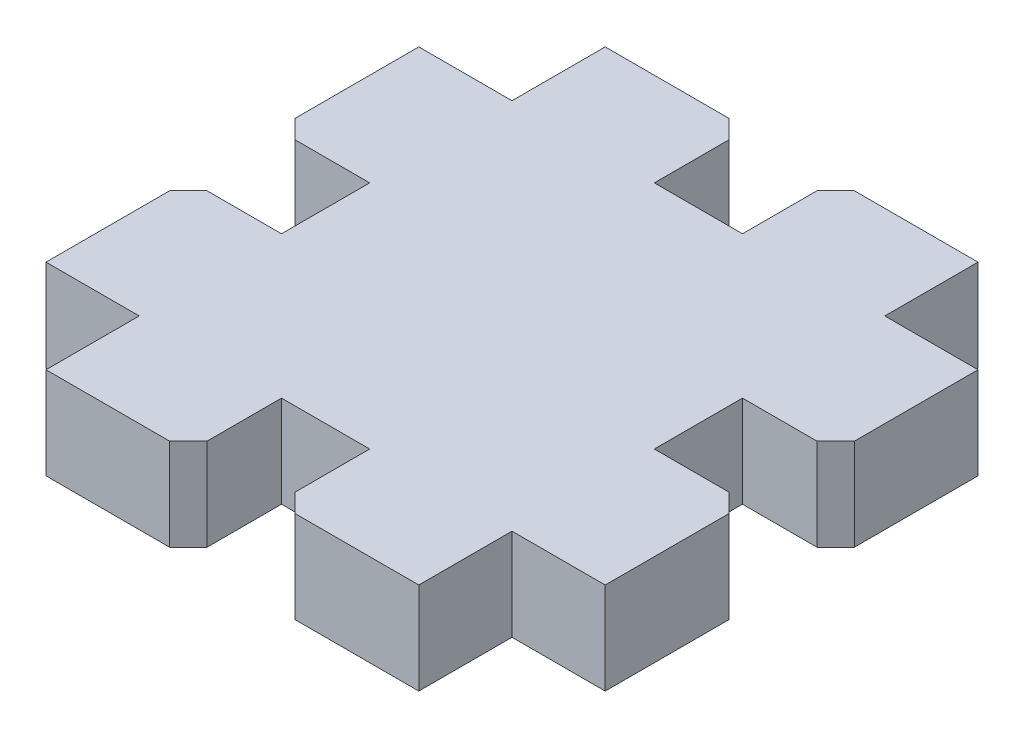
ISO-10303-21;
HEADER;
FILE_DESCRIPTION(('STEP AP214'),'2;1');
FILE_NAME('part.step','',(''),(''),'','','');
FILE_SCHEMA(('AUTOMOTIVE_DESIGN { 1 0 10303 214 1 1 1 1 }'));
ENDSEC;
DATA;
#1=APPLICATION_CONTEXT('core data for automotive mechanical design processes');
#2=APPLICATION_PROTOCOL_DEFINITION('international standard','automotive_design',2000,#1);
#3=PRODUCT_CONTEXT('',#1,'mechanical');
#4=PRODUCT('Part','Part','',(#3));
#5=PRODUCT_RELATED_PRODUCT_CATEGORY('part','',(#4));
#6=PRODUCT_DEFINITION_FORMATION('','',#4);
#7=PRODUCT_DEFINITION_CONTEXT('part definition',#1,'design');
#8=PRODUCT_DEFINITION('design','',#6,#7);
#9=PRODUCT_DEFINITION_SHAPE('','',#8);
#10=(LENGTH_UNIT() NAMED_UNIT(*) SI_UNIT(.MILLI.,.METRE.));
#11=(NAMED_UNIT(*) PLANE_ANGLE_UNIT() SI_UNIT($,.RADIAN.));
#12=(NAMED_UNIT(*) SI_UNIT($,.STERADIAN.) SOLID_ANGLE_UNIT());
#13=UNCERTAINTY_MEASURE_WITH_UNIT(LENGTH_MEASURE(1.E-05),#10,'distance_accuracy_value','');
#14=(GEOMETRIC_REPRESENTATION_CONTEXT(3) GLOBAL_UNCERTAINTY_ASSIGNED_CONTEXT((#13)) GLOBAL_UNIT_ASSIGNED_CONTEXT((#10,
#11,#12)) REPRESENTATION_CONTEXT('',''));
#15=CARTESIAN_POINT('',(0.,0.,0.));
#16=DIRECTION('',(0.,0.,1.));
#17=DIRECTION('',(1.,0.,0.));
#18=AXIS2_PLACEMENT_3D('',#15,#16,#17);
#19=CARTESIAN_POINT('',(-12.7,6.2611,11.2645620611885));
#20=DIRECTION('',(0.,0.,-1.));
#21=DIRECTION('',(-1.,0.,0.));
#22=AXIS2_PLACEMENT_3D('',#19,#20,#21);
#23=PLANE('',#22);
#24=DIRECTION('',(1.,0.,0.));
#25=VECTOR('',#24,1.);
#26=CARTESIAN_POINT('',(-12.7,0.,11.2645620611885));
#27=LINE('',#26,#25);
#28=CARTESIAN_POINT('',(-12.7,0.,11.2645620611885));
#29=VERTEX_POINT('',#28);
#30=CARTESIAN_POINT('',(-4.27355000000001,0.,11.2645620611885));
#31=VERTEX_POINT('',#30);
#32=EDGE_CURVE('E354',#29,#31,#27,.T.);
#33=ORIENTED_EDGE('',*,*,#32,.T.);
#34=DIRECTION('',(0.,1.,0.));
#35=VECTOR('',#34,1.);
#36=CARTESIAN_POINT('',(-4.27355000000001,6.2611,11.2645620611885));
#37=LINE('',#36,#35);
#38=CARTESIAN_POINT('',(-4.27355000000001,6.2611,11.2645620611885));
#39=VERTEX_POINT('',#38);
#40=EDGE_CURVE('E526',#31,#39,#37,.T.);
#41=ORIENTED_EDGE('',*,*,#40,.T.);
#42=DIRECTION('',(1.,0.,0.));
#43=VECTOR('',#42,1.);
#44=CARTESIAN_POINT('',(-12.7,6.2611,11.2645620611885));
#45=LINE('',#44,#43);
#46=CARTESIAN_POINT('',(-12.7,6.2611,11.2645620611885));
#47=VERTEX_POINT('',#46);
#48=EDGE_CURVE('E281',#47,#39,#45,.T.);
#49=ORIENTED_EDGE('',*,*,#48,.F.);
#50=DIRECTION('',(0.,-1.,0.));
#51=VECTOR('',#50,1.);
#52=CARTESIAN_POINT('',(-12.7,6.2611,11.2645620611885));
#53=LINE('',#52,#51);
#54=EDGE_CURVE('E353',#47,#29,#53,.T.);
#55=ORIENTED_EDGE('',*,*,#54,.T.);
#56=EDGE_LOOP('',(#33,#41,#49,#55));
#57=FACE_BOUND('',#56,.T.);
#58=ADVANCED_FACE('F35',(#57),#23,.F.);
#59=CARTESIAN_POINT('',(-3.00355,6.2611,11.2645620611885));
#60=DIRECTION('',(-1.,0.,0.));
#61=DIRECTION('',(0.,0.,1.));
#62=AXIS2_PLACEMENT_3D('',#59,#60,#61);
#63=PLANE('',#62);
#64=DIRECTION('',(0.,0.,-1.));
#65=VECTOR('',#64,1.);
#66=CARTESIAN_POINT('',(-3.00355,6.2611,11.2645620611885));
#67=LINE('',#66,#65);
#68=CARTESIAN_POINT('',(-3.00355,6.2611,9.99456206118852));
#69=VERTEX_POINT('',#68);
#70=CARTESIAN_POINT('',(-3.00355,6.2611,4.91456206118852));
#71=VERTEX_POINT('',#70);
#72=EDGE_CURVE('E267',#69,#71,#67,.T.);
#73=ORIENTED_EDGE('',*,*,#72,.F.);
#74=DIRECTION('',(0.,-1.,0.));
#75=VECTOR('',#74,1.);
#76=CARTESIAN_POINT('',(-3.00355,6.2611,9.99456206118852));
#77=LINE('',#76,#75);
#78=CARTESIAN_POINT('',(-3.00355,0.,9.99456206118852));
#79=VERTEX_POINT('',#78);
#80=EDGE_CURVE('E524',#69,#79,#77,.T.);
#81=ORIENTED_EDGE('',*,*,#80,.T.);
#82=DIRECTION('',(0.,0.,-1.));
#83=VECTOR('',#82,1.);
#84=CARTESIAN_POINT('',(-3.00355,0.,11.2645620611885));
#85=LINE('',#84,#83);
#86=CARTESIAN_POINT('',(-3.00355,0.,4.91456206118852));
#87=VERTEX_POINT('',#86);
#88=EDGE_CURVE('E287',#79,#87,#85,.T.);
#89=ORIENTED_EDGE('',*,*,#88,.T.);
#90=DIRECTION('',(0.,-1.,0.));
#91=VECTOR('',#90,1.);
#92=CARTESIAN_POINT('',(-3.00355,6.2611,4.91456206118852));
#93=LINE('',#92,#91);
#94=EDGE_CURVE('E284',#71,#87,#93,.T.);
#95=ORIENTED_EDGE('',*,*,#94,.F.);
#96=EDGE_LOOP('',(#73,#81,#89,#95));
#97=FACE_BOUND('',#96,.T.);
#98=ADVANCED_FACE('F285',(#97),#63,.F.);
#99=CARTESIAN_POINT('',(-3.00355,6.2611,4.91456206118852));
#100=DIRECTION('',(0.,0.,-1.));
#101=DIRECTION('',(-1.,0.,0.));
#102=AXIS2_PLACEMENT_3D('',#99,#100,#101);
#103=PLANE('',#102);
#104=DIRECTION('',(1.,0.,0.));
#105=VECTOR('',#104,1.);
#106=CARTESIAN_POINT('',(-3.00355,0.,4.91456206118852));
#107=LINE('',#106,#105);
#108=CARTESIAN_POINT('',(3.00355,0.,4.91456206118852));
#109=VERTEX_POINT('',#108);
#110=EDGE_CURVE('E358',#87,#109,#107,.T.);
#111=ORIENTED_EDGE('',*,*,#110,.T.);
#112=DIRECTION('',(0.,-1.,0.));
#113=VECTOR('',#112,1.);
#114=CARTESIAN_POINT('',(3.00355,6.2611,4.91456206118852));
#115=LINE('',#114,#113);
#116=CARTESIAN_POINT('',(3.00355,6.2611,4.91456206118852));
#117=VERTEX_POINT('',#116);
#118=EDGE_CURVE('E291',#117,#109,#115,.T.);
#119=ORIENTED_EDGE('',*,*,#118,.F.);
#120=DIRECTION('',(1.,0.,0.));
#121=VECTOR('',#120,1.);
#122=CARTESIAN_POINT('',(-3.00355,6.2611,4.91456206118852));
#123=LINE('',#122,#121);
#124=EDGE_CURVE('E273',#71,#117,#123,.T.);
#125=ORIENTED_EDGE('',*,*,#124,.F.);
#126=ORIENTED_EDGE('',*,*,#94,.T.);
#127=EDGE_LOOP('',(#111,#119,#125,#126));
#128=FACE_BOUND('',#127,.T.);
#129=ADVANCED_FACE('F293',(#128),#103,.F.);
#130=CARTESIAN_POINT('',(3.00355,6.2611,11.2645620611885));
#131=DIRECTION('',(1.,0.,0.));
#132=DIRECTION('',(0.,0.,-1.));
#133=AXIS2_PLACEMENT_3D('',#130,#131,#132);
#134=PLANE('',#133);
#135=DIRECTION('',(0.,0.,1.));
#136=VECTOR('',#135,1.);
#137=CARTESIAN_POINT('',(3.00355,0.,11.2645620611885));
#138=LINE('',#137,#136);
#139=CARTESIAN_POINT('',(3.00355,0.,9.99456206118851));
#140=VERTEX_POINT('',#139);
#141=EDGE_CURVE('E360',#109,#140,#138,.T.);
#142=ORIENTED_EDGE('',*,*,#141,.T.);
#143=DIRECTION('',(0.,1.,0.));
#144=VECTOR('',#143,1.);
#145=CARTESIAN_POINT('',(3.00355,6.2611,9.99456206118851));
#146=LINE('',#145,#144);
#147=CARTESIAN_POINT('',(3.00355,6.2611,9.99456206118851));
#148=VERTEX_POINT('',#147);
#149=EDGE_CURVE('E522',#140,#148,#146,.T.);
#150=ORIENTED_EDGE('',*,*,#149,.T.);
#151=DIRECTION('',(0.,0.,1.));
#152=VECTOR('',#151,1.);
#153=CARTESIAN_POINT('',(3.00355,6.2611,11.2645620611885));
#154=LINE('',#153,#152);
#155=EDGE_CURVE('E296',#117,#148,#154,.T.);
#156=ORIENTED_EDGE('',*,*,#155,.F.);
#157=ORIENTED_EDGE('',*,*,#118,.T.);
#158=EDGE_LOOP('',(#142,#150,#156,#157));
#159=FACE_BOUND('',#158,.T.);
#160=ADVANCED_FACE('F576',(#159),#134,.F.);
#161=CARTESIAN_POINT('',(12.7,6.2611,11.2645620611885));
#162=DIRECTION('',(0.,0.,-1.));
#163=DIRECTION('',(-1.,0.,0.));
#164=AXIS2_PLACEMENT_3D('',#161,#162,#163);
#165=PLANE('',#164);
#166=DIRECTION('',(1.,0.,0.));
#167=VECTOR('',#166,1.);
#168=CARTESIAN_POINT('',(12.7,6.2611,11.2645620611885));
#169=LINE('',#168,#167);
#170=CARTESIAN_POINT('',(4.27355,6.2611,11.2645620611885));
#171=VERTEX_POINT('',#170);
#172=CARTESIAN_POINT('',(12.7,6.2611,11.2645620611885));
#173=VERTEX_POINT('',#172);
#174=EDGE_CURVE('E298',#171,#173,#169,.T.);
#175=ORIENTED_EDGE('',*,*,#174,.F.);
#176=DIRECTION('',(0.,-1.,0.));
#177=VECTOR('',#176,1.);
#178=CARTESIAN_POINT('',(4.27355,6.2611,11.2645620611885));
#179=LINE('',#178,#177);
#180=CARTESIAN_POINT('',(4.27355,0.,11.2645620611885));
#181=VERTEX_POINT('',#180);
#182=EDGE_CURVE('E519',#171,#181,#179,.T.);
#183=ORIENTED_EDGE('',*,*,#182,.T.);
#184=DIRECTION('',(1.,0.,0.));
#185=VECTOR('',#184,1.);
#186=CARTESIAN_POINT('',(12.7,0.,11.2645620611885));
#187=LINE('',#186,#185);
#188=CARTESIAN_POINT('',(12.7,0.,11.2645620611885));
#189=VERTEX_POINT('',#188);
#190=EDGE_CURVE('E363',#181,#189,#187,.T.);
#191=ORIENTED_EDGE('',*,*,#190,.T.);
#192=DIRECTION('',(0.,-1.,0.));
#193=VECTOR('',#192,1.);
#194=CARTESIAN_POINT('',(12.7,6.2611,11.2645620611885));
#195=LINE('',#194,#193);
#196=EDGE_CURVE('E466',#173,#189,#195,.T.);
#197=ORIENTED_EDGE('',*,*,#196,.F.);
#198=EDGE_LOOP('',(#175,#183,#191,#197));
#199=FACE_BOUND('',#198,.T.);
#200=ADVANCED_FACE('F585',(#199),#165,.F.);
#201=CARTESIAN_POINT('',(12.7,6.2611,11.2645620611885));
#202=DIRECTION('',(-1.,0.,0.));
#203=DIRECTION('',(0.,0.,1.));
#204=AXIS2_PLACEMENT_3D('',#201,#202,#203);
#205=PLANE('',#204);
#206=DIRECTION('',(0.,0.,-1.));
#207=VECTOR('',#206,1.);
#208=CARTESIAN_POINT('',(12.7,0.,11.2645620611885));
#209=LINE('',#208,#207);
#210=CARTESIAN_POINT('',(12.7,0.,4.91456206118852));
#211=VERTEX_POINT('',#210);
#212=EDGE_CURVE('E365',#189,#211,#209,.T.);
#213=ORIENTED_EDGE('',*,*,#212,.T.);
#214=DIRECTION('',(0.,-1.,0.));
#215=VECTOR('',#214,1.);
#216=CARTESIAN_POINT('',(12.7,6.2611,4.91456206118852));
#217=LINE('',#216,#215);
#218=CARTESIAN_POINT('',(12.7,6.2611,4.91456206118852));
#219=VERTEX_POINT('',#218);
#220=EDGE_CURVE('E463',#219,#211,#217,.T.);
#221=ORIENTED_EDGE('',*,*,#220,.F.);
#222=DIRECTION('',(0.,0.,-1.));
#223=VECTOR('',#222,1.);
#224=CARTESIAN_POINT('',(12.7,6.2611,11.2645620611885));
#225=LINE('',#224,#223);
#226=EDGE_CURVE('E303',#173,#219,#225,.T.);
#227=ORIENTED_EDGE('',*,*,#226,.F.);
#228=ORIENTED_EDGE('',*,*,#196,.T.);
#229=EDGE_LOOP('',(#213,#221,#227,#228));
#230=FACE_BOUND('',#229,.T.);
#231=ADVANCED_FACE('F592',(#230),#205,.F.);
#232=CARTESIAN_POINT('',(12.7,6.2611,4.91456206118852));
#233=DIRECTION('',(0.,0.,-1.));
#234=DIRECTION('',(-1.,0.,0.));
#235=AXIS2_PLACEMENT_3D('',#232,#233,#234);
#236=PLANE('',#235);
#237=DIRECTION('',(1.,0.,0.));
#238=VECTOR('',#237,1.);
#239=CARTESIAN_POINT('',(12.7,0.,4.91456206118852));
#240=LINE('',#239,#238);
#241=CARTESIAN_POINT('',(19.05,0.,4.91456206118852));
#242=VERTEX_POINT('',#241);
#243=EDGE_CURVE('E367',#211,#242,#240,.T.);
#244=ORIENTED_EDGE('',*,*,#243,.T.);
#245=DIRECTION('',(0.,-1.,0.));
#246=VECTOR('',#245,1.);
#247=CARTESIAN_POINT('',(19.05,6.2611,4.91456206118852));
#248=LINE('',#247,#246);
#249=CARTESIAN_POINT('',(19.05,6.2611,4.91456206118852));
#250=VERTEX_POINT('',#249);
#251=EDGE_CURVE('E460',#250,#242,#248,.T.);
#252=ORIENTED_EDGE('',*,*,#251,.F.);
#253=DIRECTION('',(1.,0.,0.));
#254=VECTOR('',#253,1.);
#255=CARTESIAN_POINT('',(12.7,6.2611,4.91456206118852));
#256=LINE('',#255,#254);
#257=EDGE_CURVE('E305',#219,#250,#256,.T.);
#258=ORIENTED_EDGE('',*,*,#257,.F.);
#259=ORIENTED_EDGE('',*,*,#220,.T.);
#260=EDGE_LOOP('',(#244,#252,#258,#259));
#261=FACE_BOUND('',#260,.T.);
#262=ADVANCED_FACE('F596',(#261),#236,.F.);
#263=CARTESIAN_POINT('',(19.05,6.2611,4.91456206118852));
#264=DIRECTION('',(-1.,0.,0.));
#265=DIRECTION('',(0.,0.,1.));
#266=AXIS2_PLACEMENT_3D('',#263,#264,#265);
#267=PLANE('',#266);
#268=DIRECTION('',(0.,0.,-1.));
#269=VECTOR('',#268,1.);
#270=CARTESIAN_POINT('',(19.05,0.,4.91456206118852));
#271=LINE('',#270,#269);
#272=CARTESIAN_POINT('',(19.05,0.,-3.51188793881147));
#273=VERTEX_POINT('',#272);
#274=EDGE_CURVE('E369',#242,#273,#271,.T.);
#275=ORIENTED_EDGE('',*,*,#274,.T.);
#276=DIRECTION('',(0.,1.,0.));
#277=VECTOR('',#276,1.);
#278=CARTESIAN_POINT('',(19.05,6.2611,-3.51188793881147));
#279=LINE('',#278,#277);
#280=CARTESIAN_POINT('',(19.05,6.2611,-3.51188793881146));
#281=VERTEX_POINT('',#280);
#282=EDGE_CURVE('E517',#273,#281,#279,.T.);
#283=ORIENTED_EDGE('',*,*,#282,.T.);
#284=DIRECTION('',(0.,0.,-1.));
#285=VECTOR('',#284,1.);
#286=CARTESIAN_POINT('',(19.05,6.2611,4.91456206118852));
#287=LINE('',#286,#285);
#288=EDGE_CURVE('E307',#250,#281,#287,.T.);
#289=ORIENTED_EDGE('',*,*,#288,.F.);
#290=ORIENTED_EDGE('',*,*,#251,.T.);
#291=EDGE_LOOP('',(#275,#283,#289,#290));
#292=FACE_BOUND('',#291,.T.);
#293=ADVANCED_FACE('F874',(#292),#267,.F.);
#294=CARTESIAN_POINT('',(12.7,6.2611,-4.78188793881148));
#295=DIRECTION('',(0.,0.,1.));
#296=DIRECTION('',(1.,0.,0.));
#297=AXIS2_PLACEMENT_3D('',#294,#295,#296);
#298=PLANE('',#297);
#299=DIRECTION('',(-1.,0.,0.));
#300=VECTOR('',#299,1.);
#301=CARTESIAN_POINT('',(12.7,6.2611,-4.78188793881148));
#302=LINE('',#301,#300);
#303=CARTESIAN_POINT('',(17.78,6.2611,-4.78188793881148));
#304=VERTEX_POINT('',#303);
#305=CARTESIAN_POINT('',(12.7,6.2611,-4.78188793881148));
#306=VERTEX_POINT('',#305);
#307=EDGE_CURVE('E310',#304,#306,#302,.T.);
#308=ORIENTED_EDGE('',*,*,#307,.F.);
#309=DIRECTION('',(0.,-1.,0.));
#310=VECTOR('',#309,1.);
#311=CARTESIAN_POINT('',(17.78,6.2611,-4.78188793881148));
#312=LINE('',#311,#310);
#313=CARTESIAN_POINT('',(17.78,0.,-4.78188793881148));
#314=VERTEX_POINT('',#313);
#315=EDGE_CURVE('E514',#304,#314,#312,.T.);
#316=ORIENTED_EDGE('',*,*,#315,.T.);
#317=DIRECTION('',(-1.,0.,0.));
#318=VECTOR('',#317,1.);
#319=CARTESIAN_POINT('',(12.7,0.,-4.78188793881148));
#320=LINE('',#319,#318);
#321=CARTESIAN_POINT('',(12.7,0.,-4.78188793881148));
#322=VERTEX_POINT('',#321);
#323=EDGE_CURVE('E372',#314,#322,#320,.T.);
#324=ORIENTED_EDGE('',*,*,#323,.T.);
#325=DIRECTION('',(0.,-1.,0.));
#326=VECTOR('',#325,1.);
#327=CARTESIAN_POINT('',(12.7,6.2611,-4.78188793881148));
#328=LINE('',#327,#326);
#329=EDGE_CURVE('E457',#306,#322,#328,.T.);
#330=ORIENTED_EDGE('',*,*,#329,.F.);
#331=EDGE_LOOP('',(#308,#316,#324,#330));
#332=FACE_BOUND('',#331,.T.);
#333=ADVANCED_FACE('F608',(#332),#298,.F.);
#334=CARTESIAN_POINT('',(12.7,6.2611,-4.78188793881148));
#335=DIRECTION('',(-1.,0.,0.));
#336=DIRECTION('',(0.,0.,1.));
#337=AXIS2_PLACEMENT_3D('',#334,#335,#336);
#338=PLANE('',#337);
#339=DIRECTION('',(0.,0.,-1.));
#340=VECTOR('',#339,1.);
#341=CARTESIAN_POINT('',(12.7,0.,-4.78188793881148));
#342=LINE('',#341,#340);
#343=CARTESIAN_POINT('',(12.7,0.,-10.7889879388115));
#344=VERTEX_POINT('',#343);
#345=EDGE_CURVE('E374',#322,#344,#342,.T.);
#346=ORIENTED_EDGE('',*,*,#345,.T.);
#347=DIRECTION('',(0.,-1.,0.));
#348=VECTOR('',#347,1.);
#349=CARTESIAN_POINT('',(12.7,6.2611,-10.7889879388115));
#350=LINE('',#349,#348);
#351=CARTESIAN_POINT('',(12.7,6.2611,-10.7889879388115));
#352=VERTEX_POINT('',#351);
#353=EDGE_CURVE('E454',#352,#344,#350,.T.);
#354=ORIENTED_EDGE('',*,*,#353,.F.);
#355=DIRECTION('',(0.,0.,-1.));
#356=VECTOR('',#355,1.);
#357=CARTESIAN_POINT('',(12.7,6.2611,-4.78188793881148));
#358=LINE('',#357,#356);
#359=EDGE_CURVE('E312',#306,#352,#358,.T.);
#360=ORIENTED_EDGE('',*,*,#359,.F.);
#361=ORIENTED_EDGE('',*,*,#329,.T.);
#362=EDGE_LOOP('',(#346,#354,#360,#361));
#363=FACE_BOUND('',#362,.T.);
#364=ADVANCED_FACE('F614',(#363),#338,.F.);
#365=CARTESIAN_POINT('',(12.7,6.2611,-10.7889879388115));
#366=DIRECTION('',(0.,0.,-1.));
#367=DIRECTION('',(-1.,0.,0.));
#368=AXIS2_PLACEMENT_3D('',#365,#366,#367);
#369=PLANE('',#368);
#370=DIRECTION('',(1.,0.,0.));
#371=VECTOR('',#370,1.);
#372=CARTESIAN_POINT('',(12.7,0.,-10.7889879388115));
#373=LINE('',#372,#371);
#374=CARTESIAN_POINT('',(17.78,0.,-10.7889879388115));
#375=VERTEX_POINT('',#374);
#376=EDGE_CURVE('E376',#344,#375,#373,.T.);
#377=ORIENTED_EDGE('',*,*,#376,.T.);
#378=DIRECTION('',(0.,1.,0.));
#379=VECTOR('',#378,1.);
#380=CARTESIAN_POINT('',(17.78,6.2611,-10.7889879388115));
#381=LINE('',#380,#379);
#382=CARTESIAN_POINT('',(17.78,6.2611,-10.7889879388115));
#383=VERTEX_POINT('',#382);
#384=EDGE_CURVE('E512',#375,#383,#381,.T.);
#385=ORIENTED_EDGE('',*,*,#384,.T.);
#386=DIRECTION('',(1.,0.,0.));
#387=VECTOR('',#386,1.);
#388=CARTESIAN_POINT('',(12.7,6.2611,-10.7889879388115));
#389=LINE('',#388,#387);
#390=EDGE_CURVE('E314',#352,#383,#389,.T.);
#391=ORIENTED_EDGE('',*,*,#390,.F.);
#392=ORIENTED_EDGE('',*,*,#353,.T.);
#393=EDGE_LOOP('',(#377,#385,#391,#392));
#394=FACE_BOUND('',#393,.T.);
#395=ADVANCED_FACE('F618',(#394),#369,.F.);
#396=CARTESIAN_POINT('',(19.05,6.2611,-20.4854379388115));
#397=DIRECTION('',(-1.,0.,0.));
#398=DIRECTION('',(0.,0.,1.));
#399=AXIS2_PLACEMENT_3D('',#396,#397,#398);
#400=PLANE('',#399);
#401=DIRECTION('',(0.,0.,-1.));
#402=VECTOR('',#401,1.);
#403=CARTESIAN_POINT('',(19.05,6.2611,-20.4854379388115));
#404=LINE('',#403,#402);
#405=CARTESIAN_POINT('',(19.05,6.2611,-12.0589879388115));
#406=VERTEX_POINT('',#405);
#407=CARTESIAN_POINT('',(19.05,6.2611,-20.4854379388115));
#408=VERTEX_POINT('',#407);
#409=EDGE_CURVE('E317',#406,#408,#404,.T.);
#410=ORIENTED_EDGE('',*,*,#409,.F.);
#411=DIRECTION('',(0.,-1.,0.));
#412=VECTOR('',#411,1.);
#413=CARTESIAN_POINT('',(19.05,6.2611,-12.0589879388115));
#414=LINE('',#413,#412);
#415=CARTESIAN_POINT('',(19.05,0.,-12.0589879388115));
#416=VERTEX_POINT('',#415);
#417=EDGE_CURVE('E509',#406,#416,#414,.T.);
#418=ORIENTED_EDGE('',*,*,#417,.T.);
#419=DIRECTION('',(0.,0.,-1.));
#420=VECTOR('',#419,1.);
#421=CARTESIAN_POINT('',(19.05,0.,-20.4854379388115));
#422=LINE('',#421,#420);
#423=CARTESIAN_POINT('',(19.05,0.,-20.4854379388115));
#424=VERTEX_POINT('',#423);
#425=EDGE_CURVE('E379',#416,#424,#422,.T.);
#426=ORIENTED_EDGE('',*,*,#425,.T.);
#427=DIRECTION('',(0.,-1.,0.));
#428=VECTOR('',#427,1.);
#429=CARTESIAN_POINT('',(19.05,6.2611,-20.4854379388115));
#430=LINE('',#429,#428);
#431=EDGE_CURVE('E451',#408,#424,#430,.T.);
#432=ORIENTED_EDGE('',*,*,#431,.F.);
#433=EDGE_LOOP('',(#410,#418,#426,#432));
#434=FACE_BOUND('',#433,.T.);
#435=ADVANCED_FACE('F627',(#434),#400,.F.);
#436=CARTESIAN_POINT('',(12.7,6.2611,-20.4854379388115));
#437=DIRECTION('',(0.,0.,1.));
#438=DIRECTION('',(1.,0.,0.));
#439=AXIS2_PLACEMENT_3D('',#436,#437,#438);
#440=PLANE('',#439);
#441=DIRECTION('',(-1.,0.,0.));
#442=VECTOR('',#441,1.);
#443=CARTESIAN_POINT('',(12.7,0.,-20.4854379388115));
#444=LINE('',#443,#442);
#445=CARTESIAN_POINT('',(12.7,0.,-20.4854379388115));
#446=VERTEX_POINT('',#445);
#447=EDGE_CURVE('E381',#424,#446,#444,.T.);
#448=ORIENTED_EDGE('',*,*,#447,.T.);
#449=DIRECTION('',(0.,-1.,0.));
#450=VECTOR('',#449,1.);
#451=CARTESIAN_POINT('',(12.7,6.2611,-20.4854379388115));
#452=LINE('',#451,#450);
#453=CARTESIAN_POINT('',(12.7,6.2611,-20.4854379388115));
#454=VERTEX_POINT('',#453);
#455=EDGE_CURVE('E448',#454,#446,#452,.T.);
#456=ORIENTED_EDGE('',*,*,#455,.F.);
#457=DIRECTION('',(-1.,0.,0.));
#458=VECTOR('',#457,1.);
#459=CARTESIAN_POINT('',(12.7,6.2611,-20.4854379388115));
#460=LINE('',#459,#458);
#461=EDGE_CURVE('E319',#408,#454,#460,.T.);
#462=ORIENTED_EDGE('',*,*,#461,.F.);
#463=ORIENTED_EDGE('',*,*,#431,.T.);
#464=EDGE_LOOP('',(#448,#456,#462,#463));
#465=FACE_BOUND('',#464,.T.);
#466=ADVANCED_FACE('F634',(#465),#440,.F.);
#467=CARTESIAN_POINT('',(12.7,6.2611,-26.8354379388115));
#468=DIRECTION('',(-1.,0.,0.));
#469=DIRECTION('',(0.,0.,1.));
#470=AXIS2_PLACEMENT_3D('',#467,#468,#469);
#471=PLANE('',#470);
#472=DIRECTION('',(0.,0.,-1.));
#473=VECTOR('',#472,1.);
#474=CARTESIAN_POINT('',(12.7,0.,-26.8354379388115));
#475=LINE('',#474,#473);
#476=CARTESIAN_POINT('',(12.7,0.,-26.8354379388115));
#477=VERTEX_POINT('',#476);
#478=EDGE_CURVE('E383',#446,#477,#475,.T.);
#479=ORIENTED_EDGE('',*,*,#478,.T.);
#480=DIRECTION('',(0.,-1.,0.));
#481=VECTOR('',#480,1.);
#482=CARTESIAN_POINT('',(12.7,6.2611,-26.8354379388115));
#483=LINE('',#482,#481);
#484=CARTESIAN_POINT('',(12.7,6.2611,-26.8354379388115));
#485=VERTEX_POINT('',#484);
#486=EDGE_CURVE('E445',#485,#477,#483,.T.);
#487=ORIENTED_EDGE('',*,*,#486,.F.);
#488=DIRECTION('',(0.,0.,-1.));
#489=VECTOR('',#488,1.);
#490=CARTESIAN_POINT('',(12.7,6.2611,-26.8354379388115));
#491=LINE('',#490,#489);
#492=EDGE_CURVE('E321',#454,#485,#491,.T.);
#493=ORIENTED_EDGE('',*,*,#492,.F.);
#494=ORIENTED_EDGE('',*,*,#455,.T.);
#495=EDGE_LOOP('',(#479,#487,#493,#494));
#496=FACE_BOUND('',#495,.T.);
#497=ADVANCED_FACE('F638',(#496),#471,.F.);
#498=CARTESIAN_POINT('',(12.7,6.2611,-26.8354379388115));
#499=DIRECTION('',(0.,0.,1.));
#500=DIRECTION('',(1.,0.,0.));
#501=AXIS2_PLACEMENT_3D('',#498,#499,#500);
#502=PLANE('',#501);
#503=DIRECTION('',(-1.,0.,0.));
#504=VECTOR('',#503,1.);
#505=CARTESIAN_POINT('',(12.7,0.,-26.8354379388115));
#506=LINE('',#505,#504);
#507=CARTESIAN_POINT('',(4.27355000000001,0.,-26.8354379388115));
#508=VERTEX_POINT('',#507);
#509=EDGE_CURVE('E385',#477,#508,#506,.T.);
#510=ORIENTED_EDGE('',*,*,#509,.T.);
#511=DIRECTION('',(0.,1.,0.));
#512=VECTOR('',#511,1.);
#513=CARTESIAN_POINT('',(4.27355000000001,6.2611,-26.8354379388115));
#514=LINE('',#513,#512);
#515=CARTESIAN_POINT('',(4.27355,6.2611,-26.8354379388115));
#516=VERTEX_POINT('',#515);
#517=EDGE_CURVE('E488',#508,#516,#514,.T.);
#518=ORIENTED_EDGE('',*,*,#517,.T.);
#519=DIRECTION('',(-1.,0.,0.));
#520=VECTOR('',#519,1.);
#521=CARTESIAN_POINT('',(12.7,6.2611,-26.8354379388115));
#522=LINE('',#521,#520);
#523=EDGE_CURVE('E323',#485,#516,#522,.T.);
#524=ORIENTED_EDGE('',*,*,#523,.F.);
#525=ORIENTED_EDGE('',*,*,#486,.T.);
#526=EDGE_LOOP('',(#510,#518,#524,#525));
#527=FACE_BOUND('',#526,.T.);
#528=ADVANCED_FACE('F835',(#527),#502,.F.);
#529=CARTESIAN_POINT('',(3.00355,6.2611,-26.8354379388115));
#530=DIRECTION('',(1.,0.,0.));
#531=DIRECTION('',(0.,0.,-1.));
#532=AXIS2_PLACEMENT_3D('',#529,#530,#531);
#533=PLANE('',#532);
#534=DIRECTION('',(0.,0.,1.));
#535=VECTOR('',#534,1.);
#536=CARTESIAN_POINT('',(3.00355,6.2611,-26.8354379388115));
#537=LINE('',#536,#535);
#538=CARTESIAN_POINT('',(3.00355,6.2611,-25.5654379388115));
#539=VERTEX_POINT('',#538);
#540=CARTESIAN_POINT('',(3.00355,6.2611,-20.4854379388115));
#541=VERTEX_POINT('',#540);
#542=EDGE_CURVE('E325',#539,#541,#537,.T.);
#543=ORIENTED_EDGE('',*,*,#542,.F.);
#544=DIRECTION('',(0.,-1.,0.));
#545=VECTOR('',#544,1.);
#546=CARTESIAN_POINT('',(3.00355,6.2611,-25.5654379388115));
#547=LINE('',#546,#545);
#548=CARTESIAN_POINT('',(3.00355,0.,-25.5654379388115));
#549=VERTEX_POINT('',#548);
#550=EDGE_CURVE('E290',#539,#549,#547,.T.);
#551=ORIENTED_EDGE('',*,*,#550,.T.);
#552=DIRECTION('',(0.,0.,1.));
#553=VECTOR('',#552,1.);
#554=CARTESIAN_POINT('',(3.00355,0.,-26.8354379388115));
#555=LINE('',#554,#553);
#556=CARTESIAN_POINT('',(3.00355,0.,-20.4854379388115));
#557=VERTEX_POINT('',#556);
#558=EDGE_CURVE('E388',#549,#557,#555,.T.);
#559=ORIENTED_EDGE('',*,*,#558,.T.);
#560=DIRECTION('',(0.,-1.,0.));
#561=VECTOR('',#560,1.);
#562=CARTESIAN_POINT('',(3.00355,6.2611,-20.4854379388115));
#563=LINE('',#562,#561);
#564=EDGE_CURVE('E442',#541,#557,#563,.T.);
#565=ORIENTED_EDGE('',*,*,#564,.F.);
#566=EDGE_LOOP('',(#543,#551,#559,#565));
#567=FACE_BOUND('',#566,.T.);
#568=ADVANCED_FACE('F649',(#567),#533,.F.);
#569=CARTESIAN_POINT('',(-3.00355,6.2611,-20.4854379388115));
#570=DIRECTION('',(0.,0.,1.));
#571=DIRECTION('',(1.,0.,0.));
#572=AXIS2_PLACEMENT_3D('',#569,#570,#571);
#573=PLANE('',#572);
#574=DIRECTION('',(-1.,0.,0.));
#575=VECTOR('',#574,1.);
#576=CARTESIAN_POINT('',(-3.00355,0.,-20.4854379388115));
#577=LINE('',#576,#575);
#578=CARTESIAN_POINT('',(-3.00355,0.,-20.4854379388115));
#579=VERTEX_POINT('',#578);
#580=EDGE_CURVE('E390',#557,#579,#577,.T.);
#581=ORIENTED_EDGE('',*,*,#580,.T.);
#582=DIRECTION('',(0.,-1.,0.));
#583=VECTOR('',#582,1.);
#584=CARTESIAN_POINT('',(-3.00355,6.2611,-20.4854379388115));
#585=LINE('',#584,#583);
#586=CARTESIAN_POINT('',(-3.00355,6.2611,-20.4854379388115));
#587=VERTEX_POINT('',#586);
#588=EDGE_CURVE('E439',#587,#579,#585,.T.);
#589=ORIENTED_EDGE('',*,*,#588,.F.);
#590=DIRECTION('',(-1.,0.,0.));
#591=VECTOR('',#590,1.);
#592=CARTESIAN_POINT('',(-3.00355,6.2611,-20.4854379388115));
#593=LINE('',#592,#591);
#594=EDGE_CURVE('E327',#541,#587,#593,.T.);
#595=ORIENTED_EDGE('',*,*,#594,.F.);
#596=ORIENTED_EDGE('',*,*,#564,.T.);
#597=EDGE_LOOP('',(#581,#589,#595,#596));
#598=FACE_BOUND('',#597,.T.);
#599=ADVANCED_FACE('F655',(#598),#573,.F.);
#600=CARTESIAN_POINT('',(-3.00355,6.2611,-26.8354379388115));
#601=DIRECTION('',(-1.,0.,0.));
#602=DIRECTION('',(0.,0.,1.));
#603=AXIS2_PLACEMENT_3D('',#600,#601,#602);
#604=PLANE('',#603);
#605=DIRECTION('',(0.,0.,-1.));
#606=VECTOR('',#605,1.);
#607=CARTESIAN_POINT('',(-3.00355,0.,-26.8354379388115));
#608=LINE('',#607,#606);
#609=CARTESIAN_POINT('',(-3.00355,0.,-25.5654379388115));
#610=VERTEX_POINT('',#609);
#611=EDGE_CURVE('E392',#579,#610,#608,.T.);
#612=ORIENTED_EDGE('',*,*,#611,.T.);
#613=DIRECTION('',(0.,1.,0.));
#614=VECTOR('',#613,1.);
#615=CARTESIAN_POINT('',(-3.00355,6.2611,-25.5654379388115));
#616=LINE('',#615,#614);
#617=CARTESIAN_POINT('',(-3.00355,6.2611,-25.5654379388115));
#618=VERTEX_POINT('',#617);
#619=EDGE_CURVE('E507',#610,#618,#616,.T.);
#620=ORIENTED_EDGE('',*,*,#619,.T.);
#621=DIRECTION('',(0.,0.,-1.));
#622=VECTOR('',#621,1.);
#623=CARTESIAN_POINT('',(-3.00355,6.2611,-26.8354379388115));
#624=LINE('',#623,#622);
#625=EDGE_CURVE('E329',#587,#618,#624,.T.);
#626=ORIENTED_EDGE('',*,*,#625,.F.);
#627=ORIENTED_EDGE('',*,*,#588,.T.);
#628=EDGE_LOOP('',(#612,#620,#626,#627));
#629=FACE_BOUND('',#628,.T.);
#630=ADVANCED_FACE('F659',(#629),#604,.F.);
#631=CARTESIAN_POINT('',(-12.7,6.2611,-26.8354379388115));
#632=DIRECTION('',(0.,0.,1.));
#633=DIRECTION('',(1.,0.,0.));
#634=AXIS2_PLACEMENT_3D('',#631,#632,#633);
#635=PLANE('',#634);
#636=DIRECTION('',(-1.,0.,0.));
#637=VECTOR('',#636,1.);
#638=CARTESIAN_POINT('',(-12.7,6.2611,-26.8354379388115));
#639=LINE('',#638,#637);
#640=CARTESIAN_POINT('',(-4.27355,6.2611,-26.8354379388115));
#641=VERTEX_POINT('',#640);
#642=CARTESIAN_POINT('',(-12.7,6.2611,-26.8354379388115));
#643=VERTEX_POINT('',#642);
#644=EDGE_CURVE('E332',#641,#643,#639,.T.);
#645=ORIENTED_EDGE('',*,*,#644,.F.);
#646=DIRECTION('',(0.,-1.,0.));
#647=VECTOR('',#646,1.);
#648=CARTESIAN_POINT('',(-4.27355,6.2611,-26.8354379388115));
#649=LINE('',#648,#647);
#650=CARTESIAN_POINT('',(-4.27355,0.,-26.8354379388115));
#651=VERTEX_POINT('',#650);
#652=EDGE_CURVE('E504',#641,#651,#649,.T.);
#653=ORIENTED_EDGE('',*,*,#652,.T.);
#654=DIRECTION('',(-1.,0.,0.));
#655=VECTOR('',#654,1.);
#656=CARTESIAN_POINT('',(-12.7,0.,-26.8354379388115));
#657=LINE('',#656,#655);
#658=CARTESIAN_POINT('',(-12.7,0.,-26.8354379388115));
#659=VERTEX_POINT('',#658);
#660=EDGE_CURVE('E395',#651,#659,#657,.T.);
#661=ORIENTED_EDGE('',*,*,#660,.T.);
#662=DIRECTION('',(0.,-1.,0.));
#663=VECTOR('',#662,1.);
#664=CARTESIAN_POINT('',(-12.7,6.2611,-26.8354379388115));
#665=LINE('',#664,#663);
#666=EDGE_CURVE('E436',#643,#659,#665,.T.);
#667=ORIENTED_EDGE('',*,*,#666,.F.);
#668=EDGE_LOOP('',(#645,#653,#661,#667));
#669=FACE_BOUND('',#668,.T.);
#670=ADVANCED_FACE('F668',(#669),#635,.F.);
#671=CARTESIAN_POINT('',(-12.7,6.2611,-26.8354379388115));
#672=DIRECTION('',(1.,0.,0.));
#673=DIRECTION('',(0.,0.,-1.));
#674=AXIS2_PLACEMENT_3D('',#671,#672,#673);
#675=PLANE('',#674);
#676=DIRECTION('',(0.,0.,1.));
#677=VECTOR('',#676,1.);
#678=CARTESIAN_POINT('',(-12.7,0.,-26.8354379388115));
#679=LINE('',#678,#677);
#680=CARTESIAN_POINT('',(-12.7,0.,-20.4854379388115));
#681=VERTEX_POINT('',#680);
#682=EDGE_CURVE('E397',#659,#681,#679,.T.);
#683=ORIENTED_EDGE('',*,*,#682,.T.);
#684=DIRECTION('',(0.,-1.,0.));
#685=VECTOR('',#684,1.);
#686=CARTESIAN_POINT('',(-12.7,6.2611,-20.4854379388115));
#687=LINE('',#686,#685);
#688=CARTESIAN_POINT('',(-12.7,6.2611,-20.4854379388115));
#689=VERTEX_POINT('',#688);
#690=EDGE_CURVE('E433',#689,#681,#687,.T.);
#691=ORIENTED_EDGE('',*,*,#690,.F.);
#692=DIRECTION('',(0.,0.,1.));
#693=VECTOR('',#692,1.);
#694=CARTESIAN_POINT('',(-12.7,6.2611,-26.8354379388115));
#695=LINE('',#694,#693);
#696=EDGE_CURVE('E334',#643,#689,#695,.T.);
#697=ORIENTED_EDGE('',*,*,#696,.F.);
#698=ORIENTED_EDGE('',*,*,#666,.T.);
#699=EDGE_LOOP('',(#683,#691,#697,#698));
#700=FACE_BOUND('',#699,.T.);
#701=ADVANCED_FACE('F674',(#700),#675,.F.);
#702=CARTESIAN_POINT('',(-12.7,6.2611,-20.4854379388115));
#703=DIRECTION('',(0.,0.,1.));
#704=DIRECTION('',(1.,0.,0.));
#705=AXIS2_PLACEMENT_3D('',#702,#703,#704);
#706=PLANE('',#705);
#707=DIRECTION('',(-1.,0.,0.));
#708=VECTOR('',#707,1.);
#709=CARTESIAN_POINT('',(-12.7,0.,-20.4854379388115));
#710=LINE('',#709,#708);
#711=CARTESIAN_POINT('',(-19.05,0.,-20.4854379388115));
#712=VERTEX_POINT('',#711);
#713=EDGE_CURVE('E399',#681,#712,#710,.T.);
#714=ORIENTED_EDGE('',*,*,#713,.T.);
#715=DIRECTION('',(0.,-1.,0.));
#716=VECTOR('',#715,1.);
#717=CARTESIAN_POINT('',(-19.05,6.2611,-20.4854379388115));
#718=LINE('',#717,#716);
#719=CARTESIAN_POINT('',(-19.05,6.2611,-20.4854379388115));
#720=VERTEX_POINT('',#719);
#721=EDGE_CURVE('E430',#720,#712,#718,.T.);
#722=ORIENTED_EDGE('',*,*,#721,.F.);
#723=DIRECTION('',(-1.,0.,0.));
#724=VECTOR('',#723,1.);
#725=CARTESIAN_POINT('',(-12.7,6.2611,-20.4854379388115));
#726=LINE('',#725,#724);
#727=EDGE_CURVE('E336',#689,#720,#726,.T.);
#728=ORIENTED_EDGE('',*,*,#727,.F.);
#729=ORIENTED_EDGE('',*,*,#690,.T.);
#730=EDGE_LOOP('',(#714,#722,#728,#729));
#731=FACE_BOUND('',#730,.T.);
#732=ADVANCED_FACE('F678',(#731),#706,.F.);
#733=CARTESIAN_POINT('',(-19.05,6.2611,-20.4854379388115));
#734=DIRECTION('',(1.,0.,0.));
#735=DIRECTION('',(0.,0.,-1.));
#736=AXIS2_PLACEMENT_3D('',#733,#734,#735);
#737=PLANE('',#736);
#738=DIRECTION('',(0.,0.,1.));
#739=VECTOR('',#738,1.);
#740=CARTESIAN_POINT('',(-19.05,0.,-20.4854379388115));
#741=LINE('',#740,#739);
#742=CARTESIAN_POINT('',(-19.05,0.,-12.0589879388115));
#743=VERTEX_POINT('',#742);
#744=EDGE_CURVE('E401',#712,#743,#741,.T.);
#745=ORIENTED_EDGE('',*,*,#744,.T.);
#746=DIRECTION('',(0.,1.,0.));
#747=VECTOR('',#746,1.);
#748=CARTESIAN_POINT('',(-19.05,6.2611,-12.0589879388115));
#749=LINE('',#748,#747);
#750=CARTESIAN_POINT('',(-19.05,6.2611,-12.0589879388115));
#751=VERTEX_POINT('',#750);
#752=EDGE_CURVE('E11',#743,#751,#749,.T.);
#753=ORIENTED_EDGE('',*,*,#752,.T.);
#754=DIRECTION('',(0.,0.,1.));
#755=VECTOR('',#754,1.);
#756=CARTESIAN_POINT('',(-19.05,6.2611,-20.4854379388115));
#757=LINE('',#756,#755);
#758=EDGE_CURVE('E338',#720,#751,#757,.T.);
#759=ORIENTED_EDGE('',*,*,#758,.F.);
#760=ORIENTED_EDGE('',*,*,#721,.T.);
#761=EDGE_LOOP('',(#745,#753,#759,#760));
#762=FACE_BOUND('',#761,.T.);
#763=ADVANCED_FACE('F683',(#762),#737,.F.);
#764=CARTESIAN_POINT('',(-12.7,6.2611,-10.7889879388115));
#765=DIRECTION('',(0.,0.,-1.));
#766=DIRECTION('',(-1.,0.,0.));
#767=AXIS2_PLACEMENT_3D('',#764,#765,#766);
#768=PLANE('',#767);
#769=DIRECTION('',(1.,0.,0.));
#770=VECTOR('',#769,1.);
#771=CARTESIAN_POINT('',(-12.7,6.2611,-10.7889879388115));
#772=LINE('',#771,#770);
#773=CARTESIAN_POINT('',(-17.78,6.2611,-10.7889879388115));
#774=VERTEX_POINT('',#773);
#775=CARTESIAN_POINT('',(-12.7,6.2611,-10.7889879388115));
#776=VERTEX_POINT('',#775);
#777=EDGE_CURVE('E341',#774,#776,#772,.T.);
#778=ORIENTED_EDGE('',*,*,#777,.F.);
#779=DIRECTION('',(0.,-1.,0.));
#780=VECTOR('',#779,1.);
#781=CARTESIAN_POINT('',(-17.78,6.2611,-10.7889879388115));
#782=LINE('',#781,#780);
#783=CARTESIAN_POINT('',(-17.78,0.,-10.7889879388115));
#784=VERTEX_POINT('',#783);
#785=EDGE_CURVE('E43',#774,#784,#782,.T.);
#786=ORIENTED_EDGE('',*,*,#785,.T.);
#787=DIRECTION('',(1.,0.,0.));
#788=VECTOR('',#787,1.);
#789=CARTESIAN_POINT('',(-12.7,0.,-10.7889879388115));
#790=LINE('',#789,#788);
#791=CARTESIAN_POINT('',(-12.7,0.,-10.7889879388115));
#792=VERTEX_POINT('',#791);
#793=EDGE_CURVE('E404',#784,#792,#790,.T.);
#794=ORIENTED_EDGE('',*,*,#793,.T.);
#795=DIRECTION('',(0.,-1.,0.));
#796=VECTOR('',#795,1.);
#797=CARTESIAN_POINT('',(-12.7,6.2611,-10.7889879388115));
#798=LINE('',#797,#796);
#799=EDGE_CURVE('E427',#776,#792,#798,.T.);
#800=ORIENTED_EDGE('',*,*,#799,.F.);
#801=EDGE_LOOP('',(#778,#786,#794,#800));
#802=FACE_BOUND('',#801,.T.);
#803=ADVANCED_FACE('F536',(#802),#768,.F.);
#804=CARTESIAN_POINT('',(-12.7,6.2611,-4.78188793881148));
#805=DIRECTION('',(1.,0.,0.));
#806=DIRECTION('',(0.,0.,-1.));
#807=AXIS2_PLACEMENT_3D('',#804,#805,#806);
#808=PLANE('',#807);
#809=DIRECTION('',(0.,0.,1.));
#810=VECTOR('',#809,1.);
#811=CARTESIAN_POINT('',(-12.7,0.,-4.78188793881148));
#812=LINE('',#811,#810);
#813=CARTESIAN_POINT('',(-12.7,0.,-4.78188793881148));
#814=VERTEX_POINT('',#813);
#815=EDGE_CURVE('E406',#792,#814,#812,.T.);
#816=ORIENTED_EDGE('',*,*,#815,.T.);
#817=DIRECTION('',(0.,-1.,0.));
#818=VECTOR('',#817,1.);
#819=CARTESIAN_POINT('',(-12.7,6.2611,-4.78188793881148));
#820=LINE('',#819,#818);
#821=CARTESIAN_POINT('',(-12.7,6.2611,-4.78188793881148));
#822=VERTEX_POINT('',#821);
#823=EDGE_CURVE('E424',#822,#814,#820,.T.);
#824=ORIENTED_EDGE('',*,*,#823,.F.);
#825=DIRECTION('',(0.,0.,1.));
#826=VECTOR('',#825,1.);
#827=CARTESIAN_POINT('',(-12.7,6.2611,-4.78188793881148));
#828=LINE('',#827,#826);
#829=EDGE_CURVE('E343',#776,#822,#828,.T.);
#830=ORIENTED_EDGE('',*,*,#829,.F.);
#831=ORIENTED_EDGE('',*,*,#799,.T.);
#832=EDGE_LOOP('',(#816,#824,#830,#831));
#833=FACE_BOUND('',#832,.T.);
#834=ADVANCED_FACE('F548',(#833),#808,.F.);
#835=CARTESIAN_POINT('',(-12.7,6.2611,-4.78188793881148));
#836=DIRECTION('',(0.,0.,1.));
#837=DIRECTION('',(1.,0.,0.));
#838=AXIS2_PLACEMENT_3D('',#835,#836,#837);
#839=PLANE('',#838);
#840=DIRECTION('',(-1.,0.,0.));
#841=VECTOR('',#840,1.);
#842=CARTESIAN_POINT('',(-12.7,0.,-4.78188793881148));
#843=LINE('',#842,#841);
#844=CARTESIAN_POINT('',(-17.78,0.,-4.78188793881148));
#845=VERTEX_POINT('',#844);
#846=EDGE_CURVE('E408',#814,#845,#843,.T.);
#847=ORIENTED_EDGE('',*,*,#846,.T.);
#848=DIRECTION('',(0.,1.,0.));
#849=VECTOR('',#848,1.);
#850=CARTESIAN_POINT('',(-17.78,6.2611,-4.78188793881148));
#851=LINE('',#850,#849);
#852=CARTESIAN_POINT('',(-17.78,6.2611,-4.78188793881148));
#853=VERTEX_POINT('',#852);
#854=EDGE_CURVE('E58',#845,#853,#851,.T.);
#855=ORIENTED_EDGE('',*,*,#854,.T.);
#856=DIRECTION('',(-1.,0.,0.));
#857=VECTOR('',#856,1.);
#858=CARTESIAN_POINT('',(-12.7,6.2611,-4.78188793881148));
#859=LINE('',#858,#857);
#860=EDGE_CURVE('E345',#822,#853,#859,.T.);
#861=ORIENTED_EDGE('',*,*,#860,.F.);
#862=ORIENTED_EDGE('',*,*,#823,.T.);
#863=EDGE_LOOP('',(#847,#855,#861,#862));
#864=FACE_BOUND('',#863,.T.);
#865=ADVANCED_FACE('F550',(#864),#839,.F.);
#866=CARTESIAN_POINT('',(-19.05,6.2611,4.91456206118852));
#867=DIRECTION('',(1.,0.,0.));
#868=DIRECTION('',(0.,0.,-1.));
#869=AXIS2_PLACEMENT_3D('',#866,#867,#868);
#870=PLANE('',#869);
#871=DIRECTION('',(0.,0.,1.));
#872=VECTOR('',#871,1.);
#873=CARTESIAN_POINT('',(-19.05,6.2611,4.91456206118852));
#874=LINE('',#873,#872);
#875=CARTESIAN_POINT('',(-19.05,6.2611,-3.51188793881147));
#876=VERTEX_POINT('',#875);
#877=CARTESIAN_POINT('',(-19.05,6.2611,4.91456206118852));
#878=VERTEX_POINT('',#877);
#879=EDGE_CURVE('E347',#876,#878,#874,.T.);
#880=ORIENTED_EDGE('',*,*,#879,.F.);
#881=DIRECTION('',(0.,-1.,0.));
#882=VECTOR('',#881,1.);
#883=CARTESIAN_POINT('',(-19.05,6.2611,-3.51188793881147));
#884=LINE('',#883,#882);
#885=CARTESIAN_POINT('',(-19.05,0.,-3.51188793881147));
#886=VERTEX_POINT('',#885);
#887=EDGE_CURVE('E528',#876,#886,#884,.T.);
#888=ORIENTED_EDGE('',*,*,#887,.T.);
#889=DIRECTION('',(0.,0.,1.));
#890=VECTOR('',#889,1.);
#891=CARTESIAN_POINT('',(-19.05,0.,4.91456206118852));
#892=LINE('',#891,#890);
#893=CARTESIAN_POINT('',(-19.05,0.,4.91456206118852));
#894=VERTEX_POINT('',#893);
#895=EDGE_CURVE('E410',#886,#894,#892,.T.);
#896=ORIENTED_EDGE('',*,*,#895,.T.);
#897=DIRECTION('',(0.,-1.,0.));
#898=VECTOR('',#897,1.);
#899=CARTESIAN_POINT('',(-19.05,6.2611,4.91456206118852));
#900=LINE('',#899,#898);
#901=EDGE_CURVE('E421',#878,#894,#900,.T.);
#902=ORIENTED_EDGE('',*,*,#901,.F.);
#903=EDGE_LOOP('',(#880,#888,#896,#902));
#904=FACE_BOUND('',#903,.T.);
#905=ADVANCED_FACE('F556',(#904),#870,.F.);
#906=CARTESIAN_POINT('',(-12.7,6.2611,4.91456206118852));
#907=DIRECTION('',(0.,0.,-1.));
#908=DIRECTION('',(-1.,0.,0.));
#909=AXIS2_PLACEMENT_3D('',#906,#907,#908);
#910=PLANE('',#909);
#911=DIRECTION('',(1.,0.,0.));
#912=VECTOR('',#911,1.);
#913=CARTESIAN_POINT('',(-12.7,0.,4.91456206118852));
#914=LINE('',#913,#912);
#915=CARTESIAN_POINT('',(-12.7,0.,4.91456206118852));
#916=VERTEX_POINT('',#915);
#917=EDGE_CURVE('E412',#894,#916,#914,.T.);
#918=ORIENTED_EDGE('',*,*,#917,.T.);
#919=DIRECTION('',(0.,-1.,0.));
#920=VECTOR('',#919,1.);
#921=CARTESIAN_POINT('',(-12.7,6.2611,4.91456206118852));
#922=LINE('',#921,#920);
#923=CARTESIAN_POINT('',(-12.7,6.2611,4.91456206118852));
#924=VERTEX_POINT('',#923);
#925=EDGE_CURVE('E418',#924,#916,#922,.T.);
#926=ORIENTED_EDGE('',*,*,#925,.F.);
#927=DIRECTION('',(1.,0.,0.));
#928=VECTOR('',#927,1.);
#929=CARTESIAN_POINT('',(-12.7,6.2611,4.91456206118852));
#930=LINE('',#929,#928);
#931=EDGE_CURVE('E349',#878,#924,#930,.T.);
#932=ORIENTED_EDGE('',*,*,#931,.F.);
#933=ORIENTED_EDGE('',*,*,#901,.T.);
#934=EDGE_LOOP('',(#918,#926,#932,#933));
#935=FACE_BOUND('',#934,.T.);
#936=ADVANCED_FACE('F563',(#935),#910,.F.);
#937=CARTESIAN_POINT('',(-12.7,6.2611,11.2645620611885));
#938=DIRECTION('',(1.,0.,0.));
#939=DIRECTION('',(0.,0.,-1.));
#940=AXIS2_PLACEMENT_3D('',#937,#938,#939);
#941=PLANE('',#940);
#942=DIRECTION('',(0.,0.,1.));
#943=VECTOR('',#942,1.);
#944=CARTESIAN_POINT('',(-12.7,0.,11.2645620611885));
#945=LINE('',#944,#943);
#946=EDGE_CURVE('E414',#916,#29,#945,.T.);
#947=ORIENTED_EDGE('',*,*,#946,.T.);
#948=ORIENTED_EDGE('',*,*,#54,.F.);
#949=DIRECTION('',(0.,0.,1.));
#950=VECTOR('',#949,1.);
#951=CARTESIAN_POINT('',(-12.7,6.2611,11.2645620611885));
#952=LINE('',#951,#950);
#953=EDGE_CURVE('E351',#924,#47,#952,.T.);
#954=ORIENTED_EDGE('',*,*,#953,.F.);
#955=ORIENTED_EDGE('',*,*,#925,.T.);
#956=EDGE_LOOP('',(#947,#948,#954,#955));
#957=FACE_BOUND('',#956,.T.);
#958=ADVANCED_FACE('F567',(#957),#941,.F.);
#959=CARTESIAN_POINT('',(-3.00355,6.2611,11.2645620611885));
#960=DIRECTION('',(0.,1.,0.));
#961=DIRECTION('',(0.,0.,1.));
#962=AXIS2_PLACEMENT_3D('',#959,#960,#961);
#963=PLANE('',#962);
#964=ORIENTED_EDGE('',*,*,#523,.T.);
#965=DIRECTION('',(0.707106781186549,0.,-0.707106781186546));
#966=VECTOR('',#965,1.);
#967=CARTESIAN_POINT('',(-18.415,6.2611,-4.14688793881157));
#968=LINE('',#967,#966);
#969=EDGE_CURVE('E502',#516,#539,#968,.F.);
#970=ORIENTED_EDGE('',*,*,#969,.T.);
#971=ORIENTED_EDGE('',*,*,#542,.T.);
#972=ORIENTED_EDGE('',*,*,#594,.T.);
#973=ORIENTED_EDGE('',*,*,#625,.T.);
#974=DIRECTION('',(0.707106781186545,0.,0.70710678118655));
#975=VECTOR('',#974,1.);
#976=CARTESIAN_POINT('',(15.41145,6.2611,-7.15043793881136));
#977=LINE('',#976,#975);
#978=EDGE_CURVE('E500',#618,#641,#977,.F.);
#979=ORIENTED_EDGE('',*,*,#978,.T.);
#980=ORIENTED_EDGE('',*,*,#644,.T.);
#981=ORIENTED_EDGE('',*,*,#696,.T.);
#982=ORIENTED_EDGE('',*,*,#727,.T.);
#983=ORIENTED_EDGE('',*,*,#758,.T.);
#984=DIRECTION('',(-0.707106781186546,0.,-0.707106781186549));
#985=VECTOR('',#984,1.);
#986=CARTESIAN_POINT('',(0.634999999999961,6.2611,7.62601206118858));
#987=LINE('',#986,#985);
#988=EDGE_CURVE('E490',#751,#774,#987,.F.);
#989=ORIENTED_EDGE('',*,*,#988,.T.);
#990=ORIENTED_EDGE('',*,*,#777,.T.);
#991=ORIENTED_EDGE('',*,*,#829,.T.);
#992=ORIENTED_EDGE('',*,*,#860,.T.);
#993=DIRECTION('',(0.707106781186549,0.,-0.707106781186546));
#994=VECTOR('',#993,1.);
#995=CARTESIAN_POINT('',(-18.415,6.2611,-4.14688793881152));
#996=LINE('',#995,#994);
#997=EDGE_CURVE('E50',#853,#876,#996,.F.);
#998=ORIENTED_EDGE('',*,*,#997,.T.);
#999=ORIENTED_EDGE('',*,*,#879,.T.);
#1000=ORIENTED_EDGE('',*,*,#931,.T.);
#1001=ORIENTED_EDGE('',*,*,#953,.T.);
#1002=ORIENTED_EDGE('',*,*,#48,.T.);
#1003=DIRECTION('',(-0.707106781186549,0.,0.707106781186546));
#1004=VECTOR('',#1003,1.);
#1005=CARTESIAN_POINT('',(-3.63855,6.2611,10.6295620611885));
#1006=LINE('',#1005,#1004);
#1007=EDGE_CURVE('E277',#39,#69,#1006,.F.);
#1008=ORIENTED_EDGE('',*,*,#1007,.T.);
#1009=ORIENTED_EDGE('',*,*,#72,.T.);
#1010=ORIENTED_EDGE('',*,*,#124,.T.);
#1011=ORIENTED_EDGE('',*,*,#155,.T.);
#1012=DIRECTION('',(-0.707106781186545,0.,-0.70710678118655));
#1013=VECTOR('',#1012,1.);
#1014=CARTESIAN_POINT('',(0.635000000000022,6.2611,7.62601206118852));
#1015=LINE('',#1014,#1013);
#1016=EDGE_CURVE('E494',#148,#171,#1015,.F.);
#1017=ORIENTED_EDGE('',*,*,#1016,.T.);
#1018=ORIENTED_EDGE('',*,*,#174,.T.);
#1019=ORIENTED_EDGE('',*,*,#226,.T.);
#1020=ORIENTED_EDGE('',*,*,#257,.T.);
#1021=ORIENTED_EDGE('',*,*,#288,.T.);
#1022=DIRECTION('',(0.707106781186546,0.,0.70710678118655));
#1023=VECTOR('',#1022,1.);
#1024=CARTESIAN_POINT('',(15.4114500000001,6.2611,-7.15043793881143));
#1025=LINE('',#1024,#1023);
#1026=EDGE_CURVE('E496',#281,#304,#1025,.F.);
#1027=ORIENTED_EDGE('',*,*,#1026,.T.);
#1028=ORIENTED_EDGE('',*,*,#307,.T.);
#1029=ORIENTED_EDGE('',*,*,#359,.T.);
#1030=ORIENTED_EDGE('',*,*,#390,.T.);
#1031=DIRECTION('',(-0.707106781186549,0.,0.707106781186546));
#1032=VECTOR('',#1031,1.);
#1033=CARTESIAN_POINT('',(-3.63855000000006,6.2611,10.6295620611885));
#1034=LINE('',#1033,#1032);
#1035=EDGE_CURVE('E498',#383,#406,#1034,.F.);
#1036=ORIENTED_EDGE('',*,*,#1035,.T.);
#1037=ORIENTED_EDGE('',*,*,#409,.T.);
#1038=ORIENTED_EDGE('',*,*,#461,.T.);
#1039=ORIENTED_EDGE('',*,*,#492,.T.);
#1040=EDGE_LOOP('',(#964,#970,#971,#972,#973,#979,#980,#981,#982,#983,#989,#990,#991,#992,#998,
#999,#1000,#1001,#1002,#1008,#1009,#1010,#1011,#1017,#1018,#1019,#1020,#1021,#1027,#1028,#1029,
#1030,#1036,#1037,#1038,#1039));
#1041=FACE_BOUND('',#1040,.T.);
#1042=ADVANCED_FACE('F270',(#1041),#963,.T.);
#1043=CARTESIAN_POINT('',(-3.00355,0.,11.2645620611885));
#1044=DIRECTION('',(0.,1.,0.));
#1045=DIRECTION('',(0.,0.,1.));
#1046=AXIS2_PLACEMENT_3D('',#1043,#1044,#1045);
#1047=PLANE('',#1046);
#1048=ORIENTED_EDGE('',*,*,#558,.F.);
#1049=DIRECTION('',(-0.707106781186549,0.,0.707106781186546));
#1050=VECTOR('',#1049,1.);
#1051=CARTESIAN_POINT('',(3.00355,0.,-25.5654379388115));
#1052=LINE('',#1051,#1050);
#1053=EDGE_CURVE('E486',#549,#508,#1052,.F.);
#1054=ORIENTED_EDGE('',*,*,#1053,.T.);
#1055=ORIENTED_EDGE('',*,*,#509,.F.);
#1056=ORIENTED_EDGE('',*,*,#478,.F.);
#1057=ORIENTED_EDGE('',*,*,#447,.F.);
#1058=ORIENTED_EDGE('',*,*,#425,.F.);
#1059=DIRECTION('',(0.707106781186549,0.,-0.707106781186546));
#1060=VECTOR('',#1059,1.);
#1061=CARTESIAN_POINT('',(19.05,0.,-12.0589879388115));
#1062=LINE('',#1061,#1060);
#1063=EDGE_CURVE('E482',#416,#375,#1062,.F.);
#1064=ORIENTED_EDGE('',*,*,#1063,.T.);
#1065=ORIENTED_EDGE('',*,*,#376,.F.);
#1066=ORIENTED_EDGE('',*,*,#345,.F.);
#1067=ORIENTED_EDGE('',*,*,#323,.F.);
#1068=DIRECTION('',(-0.707106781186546,0.,-0.70710678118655));
#1069=VECTOR('',#1068,1.);
#1070=CARTESIAN_POINT('',(17.78,0.,-4.78188793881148));
#1071=LINE('',#1070,#1069);
#1072=EDGE_CURVE('E480',#314,#273,#1071,.F.);
#1073=ORIENTED_EDGE('',*,*,#1072,.T.);
#1074=ORIENTED_EDGE('',*,*,#274,.F.);
#1075=ORIENTED_EDGE('',*,*,#243,.F.);
#1076=ORIENTED_EDGE('',*,*,#212,.F.);
#1077=ORIENTED_EDGE('',*,*,#190,.F.);
#1078=DIRECTION('',(0.707106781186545,0.,0.70710678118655));
#1079=VECTOR('',#1078,1.);
#1080=CARTESIAN_POINT('',(4.27355,0.,11.2645620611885));
#1081=LINE('',#1080,#1079);
#1082=EDGE_CURVE('E478',#181,#140,#1081,.F.);
#1083=ORIENTED_EDGE('',*,*,#1082,.T.);
#1084=ORIENTED_EDGE('',*,*,#141,.F.);
#1085=ORIENTED_EDGE('',*,*,#110,.F.);
#1086=ORIENTED_EDGE('',*,*,#88,.F.);
#1087=DIRECTION('',(0.707106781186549,0.,-0.707106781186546));
#1088=VECTOR('',#1087,1.);
#1089=CARTESIAN_POINT('',(-3.00355,0.,9.99456206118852));
#1090=LINE('',#1089,#1088);
#1091=EDGE_CURVE('E476',#79,#31,#1090,.F.);
#1092=ORIENTED_EDGE('',*,*,#1091,.T.);
#1093=ORIENTED_EDGE('',*,*,#32,.F.);
#1094=ORIENTED_EDGE('',*,*,#946,.F.);
#1095=ORIENTED_EDGE('',*,*,#917,.F.);
#1096=ORIENTED_EDGE('',*,*,#895,.F.);
#1097=DIRECTION('',(-0.707106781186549,0.,0.707106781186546));
#1098=VECTOR('',#1097,1.);
#1099=CARTESIAN_POINT('',(-19.05,0.,-3.51188793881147));
#1100=LINE('',#1099,#1098);
#1101=EDGE_CURVE('E474',#886,#845,#1100,.F.);
#1102=ORIENTED_EDGE('',*,*,#1101,.T.);
#1103=ORIENTED_EDGE('',*,*,#846,.F.);
#1104=ORIENTED_EDGE('',*,*,#815,.F.);
#1105=ORIENTED_EDGE('',*,*,#793,.F.);
#1106=DIRECTION('',(0.707106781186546,0.,0.707106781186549));
#1107=VECTOR('',#1106,1.);
#1108=CARTESIAN_POINT('',(-17.78,0.,-10.7889879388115));
#1109=LINE('',#1108,#1107);
#1110=EDGE_CURVE('E472',#784,#743,#1109,.F.);
#1111=ORIENTED_EDGE('',*,*,#1110,.T.);
#1112=ORIENTED_EDGE('',*,*,#744,.F.);
#1113=ORIENTED_EDGE('',*,*,#713,.F.);
#1114=ORIENTED_EDGE('',*,*,#682,.F.);
#1115=ORIENTED_EDGE('',*,*,#660,.F.);
#1116=DIRECTION('',(-0.707106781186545,0.,-0.70710678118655));
#1117=VECTOR('',#1116,1.);
#1118=CARTESIAN_POINT('',(-4.27355,0.,-26.8354379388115));
#1119=LINE('',#1118,#1117);
#1120=EDGE_CURVE('E484',#651,#610,#1119,.F.);
#1121=ORIENTED_EDGE('',*,*,#1120,.T.);
#1122=ORIENTED_EDGE('',*,*,#611,.F.);
#1123=ORIENTED_EDGE('',*,*,#580,.F.);
#1124=EDGE_LOOP('',(#1048,#1054,#1055,#1056,#1057,#1058,#1064,#1065,#1066,#1067,#1073,#1074,
#1075,#1076,#1077,#1083,#1084,#1085,#1086,#1092,#1093,#1094,#1095,#1096,#1102,#1103,#1104,#1105,
#1111,#1112,#1113,#1114,#1115,#1121,#1122,#1123));
#1125=FACE_BOUND('',#1124,.T.);
#1126=ADVANCED_FACE('F543',(#1125),#1047,.F.);
#1127=CARTESIAN_POINT('',(3.00355,6.2611,-25.5654379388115));
#1128=DIRECTION('',(0.707106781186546,0.,0.707106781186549));
#1129=DIRECTION('',(0.707106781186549,0.,-0.707106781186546));
#1130=AXIS2_PLACEMENT_3D('',#1127,#1128,#1129);
#1131=PLANE('',#1130);
#1132=ORIENTED_EDGE('',*,*,#969,.F.);
#1133=ORIENTED_EDGE('',*,*,#517,.F.);
#1134=ORIENTED_EDGE('',*,*,#1053,.F.);
#1135=ORIENTED_EDGE('',*,*,#550,.F.);
#1136=EDGE_LOOP('',(#1132,#1133,#1134,#1135));
#1137=FACE_BOUND('',#1136,.T.);
#1138=ADVANCED_FACE('F647',(#1137),#1131,.F.);
#1139=CARTESIAN_POINT('',(-4.27355,6.2611,-26.8354379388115));
#1140=DIRECTION('',(-0.70710678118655,0.,0.707106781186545));
#1141=DIRECTION('',(0.707106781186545,0.,0.70710678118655));
#1142=AXIS2_PLACEMENT_3D('',#1139,#1140,#1141);
#1143=PLANE('',#1142);
#1144=ORIENTED_EDGE('',*,*,#978,.F.);
#1145=ORIENTED_EDGE('',*,*,#619,.F.);
#1146=ORIENTED_EDGE('',*,*,#1120,.F.);
#1147=ORIENTED_EDGE('',*,*,#652,.F.);
#1148=EDGE_LOOP('',(#1144,#1145,#1146,#1147));
#1149=FACE_BOUND('',#1148,.T.);
#1150=ADVANCED_FACE('F665',(#1149),#1143,.F.);
#1151=CARTESIAN_POINT('',(19.05,6.2611,-12.0589879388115));
#1152=DIRECTION('',(-0.707106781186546,0.,-0.707106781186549));
#1153=DIRECTION('',(-0.707106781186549,0.,0.707106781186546));
#1154=AXIS2_PLACEMENT_3D('',#1151,#1152,#1153);
#1155=PLANE('',#1154);
#1156=ORIENTED_EDGE('',*,*,#1035,.F.);
#1157=ORIENTED_EDGE('',*,*,#384,.F.);
#1158=ORIENTED_EDGE('',*,*,#1063,.F.);
#1159=ORIENTED_EDGE('',*,*,#417,.F.);
#1160=EDGE_LOOP('',(#1156,#1157,#1158,#1159));
#1161=FACE_BOUND('',#1160,.T.);
#1162=ADVANCED_FACE('F624',(#1161),#1155,.F.);
#1163=CARTESIAN_POINT('',(17.78,6.2611,-4.78188793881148));
#1164=DIRECTION('',(-0.70710678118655,0.,0.707106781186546));
#1165=DIRECTION('',(0.707106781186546,0.,0.70710678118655));
#1166=AXIS2_PLACEMENT_3D('',#1163,#1164,#1165);
#1167=PLANE('',#1166);
#1168=ORIENTED_EDGE('',*,*,#1026,.F.);
#1169=ORIENTED_EDGE('',*,*,#282,.F.);
#1170=ORIENTED_EDGE('',*,*,#1072,.F.);
#1171=ORIENTED_EDGE('',*,*,#315,.F.);
#1172=EDGE_LOOP('',(#1168,#1169,#1170,#1171));
#1173=FACE_BOUND('',#1172,.T.);
#1174=ADVANCED_FACE('F605',(#1173),#1167,.F.);
#1175=CARTESIAN_POINT('',(4.27355,6.2611,11.2645620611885));
#1176=DIRECTION('',(0.70710678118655,0.,-0.707106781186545));
#1177=DIRECTION('',(-0.707106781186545,0.,-0.70710678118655));
#1178=AXIS2_PLACEMENT_3D('',#1175,#1176,#1177);
#1179=PLANE('',#1178);
#1180=ORIENTED_EDGE('',*,*,#1016,.F.);
#1181=ORIENTED_EDGE('',*,*,#149,.F.);
#1182=ORIENTED_EDGE('',*,*,#1082,.F.);
#1183=ORIENTED_EDGE('',*,*,#182,.F.);
#1184=EDGE_LOOP('',(#1180,#1181,#1182,#1183));
#1185=FACE_BOUND('',#1184,.T.);
#1186=ADVANCED_FACE('F582',(#1185),#1179,.F.);
#1187=CARTESIAN_POINT('',(-3.00355,6.2611,9.99456206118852));
#1188=DIRECTION('',(-0.707106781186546,0.,-0.707106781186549));
#1189=DIRECTION('',(-0.707106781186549,0.,0.707106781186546));
#1190=AXIS2_PLACEMENT_3D('',#1187,#1188,#1189);
#1191=PLANE('',#1190);
#1192=ORIENTED_EDGE('',*,*,#1007,.F.);
#1193=ORIENTED_EDGE('',*,*,#40,.F.);
#1194=ORIENTED_EDGE('',*,*,#1091,.F.);
#1195=ORIENTED_EDGE('',*,*,#80,.F.);
#1196=EDGE_LOOP('',(#1192,#1193,#1194,#1195));
#1197=FACE_BOUND('',#1196,.T.);
#1198=ADVANCED_FACE('F573',(#1197),#1191,.F.);
#1199=CARTESIAN_POINT('',(-19.05,6.2611,-3.51188793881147));
#1200=DIRECTION('',(0.707106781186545,0.,0.707106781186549));
#1201=DIRECTION('',(0.707106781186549,0.,-0.707106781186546));
#1202=AXIS2_PLACEMENT_3D('',#1199,#1200,#1201);
#1203=PLANE('',#1202);
#1204=ORIENTED_EDGE('',*,*,#997,.F.);
#1205=ORIENTED_EDGE('',*,*,#854,.F.);
#1206=ORIENTED_EDGE('',*,*,#1101,.F.);
#1207=ORIENTED_EDGE('',*,*,#887,.F.);
#1208=EDGE_LOOP('',(#1204,#1205,#1206,#1207));
#1209=FACE_BOUND('',#1208,.T.);
#1210=ADVANCED_FACE('F553',(#1209),#1203,.F.);
#1211=CARTESIAN_POINT('',(-17.78,6.2611,-10.7889879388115));
#1212=DIRECTION('',(0.707106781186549,0.,-0.707106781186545));
#1213=DIRECTION('',(-0.707106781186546,0.,-0.707106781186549));
#1214=AXIS2_PLACEMENT_3D('',#1211,#1212,#1213);
#1215=PLANE('',#1214);
#1216=ORIENTED_EDGE('',*,*,#988,.F.);
#1217=ORIENTED_EDGE('',*,*,#752,.F.);
#1218=ORIENTED_EDGE('',*,*,#1110,.F.);
#1219=ORIENTED_EDGE('',*,*,#785,.F.);
#1220=EDGE_LOOP('',(#1216,#1217,#1218,#1219));
#1221=FACE_BOUND('',#1220,.T.);
#1222=ADVANCED_FACE('F37',(#1221),#1215,.F.);
#1223=CLOSED_SHELL('',(#58,#98,#129,#160,#200,#231,#262,#293,#333,#364,#395,#435,#466,#497,#528,
#568,#599,#630,#670,#701,#732,#763,#803,#834,#865,#905,#936,#958,#1042,#1126,#1138,#1150,#1162,
#1174,#1186,#1198,#1210,#1222));
#1224=MANIFOLD_SOLID_BREP('B2',#1223);
#1225=ADVANCED_BREP_SHAPE_REPRESENTATION('',(#18,#1224),#14);
#1226=SHAPE_DEFINITION_REPRESENTATION(#9,#1225);
ENDSEC;
END-ISO-10303-21;
